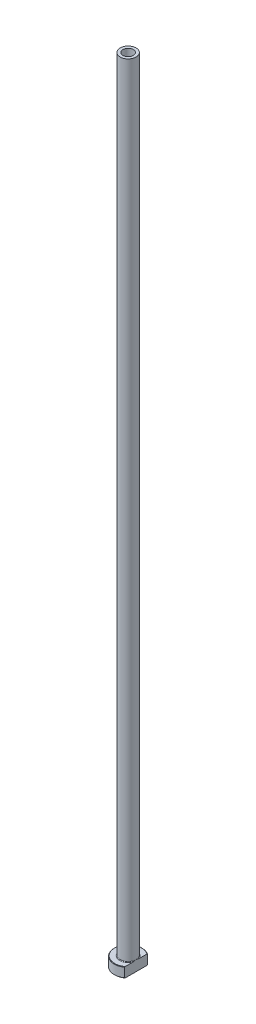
from build123d import *

# Parameters (mm, degrees)
FILLET1_R          = 0.3
CHAMFER1_SIZE      = 0.2
CUT_EXTRUDE1_DEPTH = 401.122481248
CHAMFER2_SIZE      = 0.5


with BuildPart() as part:
    # Sketch1 → Revolve1 (revolve)
    with BuildSketch(Plane.XY, mode=Mode.PRIVATE) as revolve1_sk:
        Polygon((-2.6, 400), (-4, 400), (-4, 5), (-7, 5), (-7, 0), (-2.85, 0), (-2.85, 343), (-2.6, 355), align=None)
    revolve(revolve1_sk.sketch.rotate(Axis((0, 92.187680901, 0), (0, -1, 0)), 270), axis=Axis((0, 92.187680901, 0), (0, -1, 0)))

    # Fillet1
    fillet1_edges = [part.edges().sort_by_distance(p)[0] for p in [
        (0, 5, -4),
    ]]
    fillet(fillet1_edges, radius=FILLET1_R)

    # Chamfer1
    chamfer1_edges = [part.edges().sort_by_distance(p)[0] for p in [
        (0, 0, -7),
        (0, 5, -7),
    ]]
    chamfer(chamfer1_edges, length=CHAMFER1_SIZE)

    # Sketch2 → Cut-Extrude1 (cut, through all)
    with BuildSketch(Plane.XZ):
        with BuildLine():
            Line((4, 5.744562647), (4, -5.744562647))
            ThreePointArc((4, -5.744562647), (7, 0), (4, 5.744562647))
        make_face()
    extrude(amount=-CUT_EXTRUDE1_DEPTH, mode=Mode.SUBTRACT)

    # Chamfer2
    chamfer2_edges = [part.edges().sort_by_distance(p)[0] for p in [
        (0, 0, -2.85),
    ]]
    chamfer(chamfer2_edges, length=CHAMFER2_SIZE)


solid = part.part
